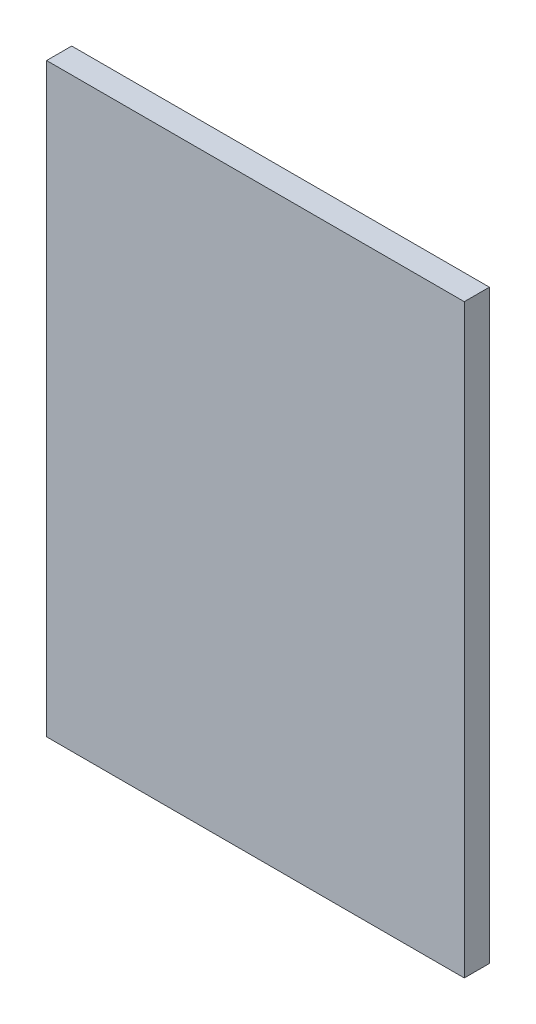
from build123d import *

# Parameters (mm, degrees)
SKETCH_1_W      = 266
SKETCH_1_H      = 373
EXTRUDE_1_DEPTH = 16


with BuildPart() as part:
    # Sketch 1 → Extrude 1 (new body)
    with BuildSketch(Plane.XY):
        Rectangle(SKETCH_1_W, SKETCH_1_H)
    extrude(amount=EXTRUDE_1_DEPTH)


solid = part.part
